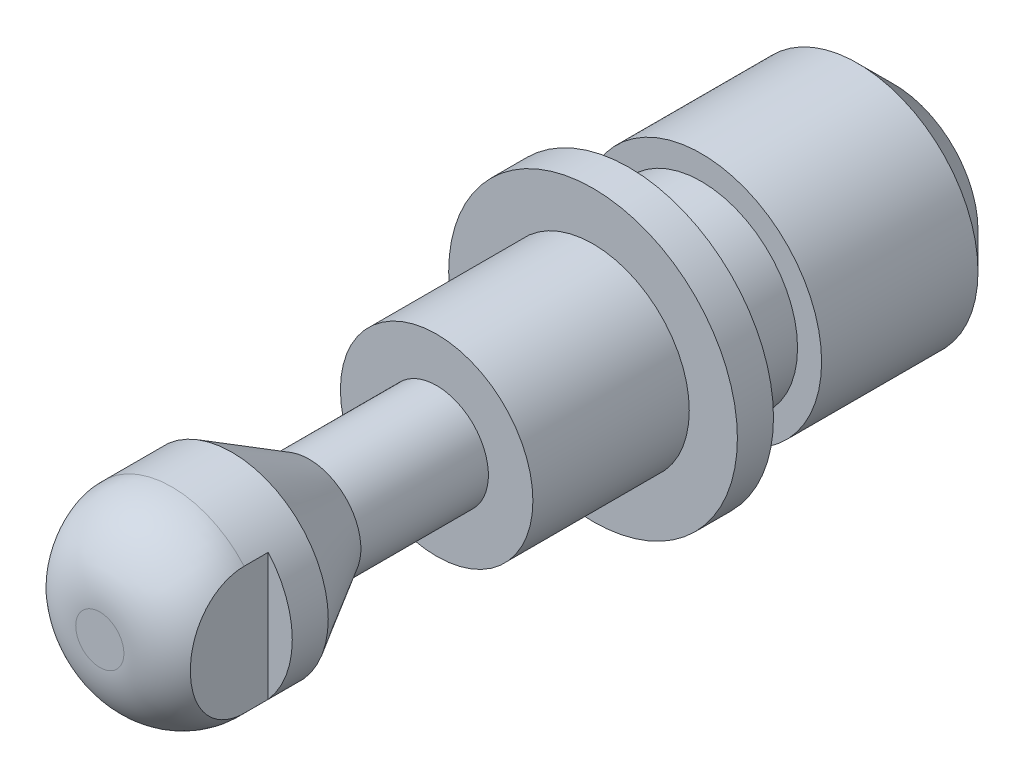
ISO-10303-21;
HEADER;
FILE_DESCRIPTION(('STEP AP214'),'2;1');
FILE_NAME('part.step','',(''),(''),'','','');
FILE_SCHEMA(('AUTOMOTIVE_DESIGN { 1 0 10303 214 1 1 1 1 }'));
ENDSEC;
DATA;
#1=APPLICATION_CONTEXT('core data for automotive mechanical design processes');
#2=APPLICATION_PROTOCOL_DEFINITION('international standard','automotive_design',2000,#1);
#3=PRODUCT_CONTEXT('',#1,'mechanical');
#4=PRODUCT('Part','Part','',(#3));
#5=PRODUCT_RELATED_PRODUCT_CATEGORY('part','',(#4));
#6=PRODUCT_DEFINITION_FORMATION('','',#4);
#7=PRODUCT_DEFINITION_CONTEXT('part definition',#1,'design');
#8=PRODUCT_DEFINITION('design','',#6,#7);
#9=PRODUCT_DEFINITION_SHAPE('','',#8);
#10=(LENGTH_UNIT() NAMED_UNIT(*) SI_UNIT(.MILLI.,.METRE.));
#11=(NAMED_UNIT(*) PLANE_ANGLE_UNIT() SI_UNIT($,.RADIAN.));
#12=(NAMED_UNIT(*) SI_UNIT($,.STERADIAN.) SOLID_ANGLE_UNIT());
#13=UNCERTAINTY_MEASURE_WITH_UNIT(LENGTH_MEASURE(1.E-05),#10,'distance_accuracy_value','');
#14=(GEOMETRIC_REPRESENTATION_CONTEXT(3) GLOBAL_UNCERTAINTY_ASSIGNED_CONTEXT((#13)) GLOBAL_UNIT_ASSIGNED_CONTEXT((#10,
#11,#12)) REPRESENTATION_CONTEXT('',''));
#15=CARTESIAN_POINT('',(0.,0.,0.));
#16=DIRECTION('',(0.,0.,1.));
#17=DIRECTION('',(1.,0.,0.));
#18=AXIS2_PLACEMENT_3D('',#15,#16,#17);
#19=CARTESIAN_POINT('',(0.,0.,0.));
#20=DIRECTION('',(0.,0.,-1.));
#21=DIRECTION('',(-1.,0.,0.));
#22=AXIS2_PLACEMENT_3D('',#19,#20,#21);
#23=CYLINDRICAL_SURFACE('',#22,6.);
#24=CARTESIAN_POINT('',(0.,0.,0.));
#25=DIRECTION('',(0.,0.,-1.));
#26=DIRECTION('',(-1.,0.,0.));
#27=AXIS2_PLACEMENT_3D('',#24,#25,#26);
#28=CIRCLE('',#27,6.);
#29=CARTESIAN_POINT('',(-6.,0.,0.));
#30=VERTEX_POINT('',#29);
#31=EDGE_CURVE('E82',#30,#30,#28,.T.);
#32=ORIENTED_EDGE('',*,*,#31,.F.);
#33=EDGE_LOOP('',(#32));
#34=FACE_BOUND('',#33,.T.);
#35=CARTESIAN_POINT('',(0.,0.,1.5));
#36=DIRECTION('',(0.,0.,-1.));
#37=DIRECTION('',(-1.,0.,0.));
#38=AXIS2_PLACEMENT_3D('',#35,#36,#37);
#39=CIRCLE('',#38,6.);
#40=CARTESIAN_POINT('',(-6.,0.,1.5));
#41=VERTEX_POINT('',#40);
#42=EDGE_CURVE('E109',#41,#41,#39,.T.);
#43=ORIENTED_EDGE('',*,*,#42,.T.);
#44=EDGE_LOOP('',(#43));
#45=FACE_BOUND('',#44,.T.);
#46=ADVANCED_FACE('F14',(#34,#45),#23,.T.);
#47=CARTESIAN_POINT('',(0.,6.,1.5));
#48=DIRECTION('',(0.,0.,-1.));
#49=DIRECTION('',(-1.,0.,0.));
#50=AXIS2_PLACEMENT_3D('',#47,#48,#49);
#51=PLANE('',#50);
#52=ORIENTED_EDGE('',*,*,#42,.F.);
#53=EDGE_LOOP('',(#52));
#54=FACE_BOUND('',#53,.T.);
#55=CARTESIAN_POINT('',(0.,0.,1.5));
#56=DIRECTION('',(0.,0.,-1.));
#57=DIRECTION('',(-1.,0.,0.));
#58=AXIS2_PLACEMENT_3D('',#55,#56,#57);
#59=CIRCLE('',#58,4.);
#60=CARTESIAN_POINT('',(-4.,0.,1.5));
#61=VERTEX_POINT('',#60);
#62=EDGE_CURVE('E106',#61,#61,#59,.T.);
#63=ORIENTED_EDGE('',*,*,#62,.T.);
#64=EDGE_LOOP('',(#63));
#65=FACE_BOUND('',#64,.T.);
#66=ADVANCED_FACE('F156',(#54,#65),#51,.F.);
#67=CARTESIAN_POINT('',(0.,0.,0.));
#68=DIRECTION('',(0.,0.,-1.));
#69=DIRECTION('',(-1.,0.,0.));
#70=AXIS2_PLACEMENT_3D('',#67,#68,#69);
#71=CYLINDRICAL_SURFACE('',#70,4.);
#72=ORIENTED_EDGE('',*,*,#62,.F.);
#73=EDGE_LOOP('',(#72));
#74=FACE_BOUND('',#73,.T.);
#75=CARTESIAN_POINT('',(0.,0.,8.));
#76=DIRECTION('',(0.,0.,-1.));
#77=DIRECTION('',(-1.,0.,0.));
#78=AXIS2_PLACEMENT_3D('',#75,#76,#77);
#79=CIRCLE('',#78,4.);
#80=CARTESIAN_POINT('',(-4.,0.,8.));
#81=VERTEX_POINT('',#80);
#82=EDGE_CURVE('E103',#81,#81,#79,.T.);
#83=ORIENTED_EDGE('',*,*,#82,.T.);
#84=EDGE_LOOP('',(#83));
#85=FACE_BOUND('',#84,.T.);
#86=ADVANCED_FACE('F162',(#74,#85),#71,.T.);
#87=CARTESIAN_POINT('',(0.,2.15,8.));
#88=DIRECTION('',(0.,0.,-1.));
#89=DIRECTION('',(-1.,0.,0.));
#90=AXIS2_PLACEMENT_3D('',#87,#88,#89);
#91=PLANE('',#90);
#92=ORIENTED_EDGE('',*,*,#82,.F.);
#93=EDGE_LOOP('',(#92));
#94=FACE_BOUND('',#93,.T.);
#95=CARTESIAN_POINT('',(0.,0.,8.));
#96=DIRECTION('',(0.,0.,-1.));
#97=DIRECTION('',(-1.,0.,0.));
#98=AXIS2_PLACEMENT_3D('',#95,#96,#97);
#99=CIRCLE('',#98,2.15);
#100=CARTESIAN_POINT('',(-2.15,0.,8.));
#101=VERTEX_POINT('',#100);
#102=EDGE_CURVE('E100',#101,#101,#99,.T.);
#103=ORIENTED_EDGE('',*,*,#102,.T.);
#104=EDGE_LOOP('',(#103));
#105=FACE_BOUND('',#104,.T.);
#106=ADVANCED_FACE('F170',(#94,#105),#91,.F.);
#107=CARTESIAN_POINT('',(0.,0.,0.));
#108=DIRECTION('',(0.,0.,-1.));
#109=DIRECTION('',(-1.,0.,0.));
#110=AXIS2_PLACEMENT_3D('',#107,#108,#109);
#111=CYLINDRICAL_SURFACE('',#110,2.15);
#112=ORIENTED_EDGE('',*,*,#102,.F.);
#113=EDGE_LOOP('',(#112));
#114=FACE_BOUND('',#113,.T.);
#115=CARTESIAN_POINT('',(0.,0.,13.3));
#116=DIRECTION('',(0.,0.,-1.));
#117=DIRECTION('',(-1.,0.,0.));
#118=AXIS2_PLACEMENT_3D('',#115,#116,#117);
#119=CIRCLE('',#118,2.15);
#120=CARTESIAN_POINT('',(-2.15,0.,13.3));
#121=VERTEX_POINT('',#120);
#122=EDGE_CURVE('E97',#121,#121,#119,.T.);
#123=ORIENTED_EDGE('',*,*,#122,.T.);
#124=EDGE_LOOP('',(#123));
#125=FACE_BOUND('',#124,.T.);
#126=ADVANCED_FACE('F174',(#114,#125),#111,.T.);
#127=CARTESIAN_POINT('',(0.,0.,16.5042939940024));
#128=DIRECTION('',(0.,0.,1.));
#129=DIRECTION('',(1.,0.,0.));
#130=AXIS2_PLACEMENT_3D('',#127,#128,#129);
#131=CONICAL_SURFACE('',#130,4.,0.523598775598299);
#132=ORIENTED_EDGE('',*,*,#122,.F.);
#133=EDGE_LOOP('',(#132));
#134=FACE_BOUND('',#133,.T.);
#135=CARTESIAN_POINT('',(0.,0.,16.5042939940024));
#136=DIRECTION('',(0.,0.,-1.));
#137=DIRECTION('',(-1.,0.,0.));
#138=AXIS2_PLACEMENT_3D('',#135,#136,#137);
#139=CIRCLE('',#138,4.);
#140=CARTESIAN_POINT('',(-4.,0.,16.5042939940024));
#141=VERTEX_POINT('',#140);
#142=EDGE_CURVE('E94',#141,#141,#139,.T.);
#143=ORIENTED_EDGE('',*,*,#142,.T.);
#144=EDGE_LOOP('',(#143));
#145=FACE_BOUND('',#144,.T.);
#146=ADVANCED_FACE('F178',(#134,#145),#131,.T.);
#147=CARTESIAN_POINT('',(0.,0.,0.));
#148=DIRECTION('',(0.,0.,-1.));
#149=DIRECTION('',(-1.,0.,0.));
#150=AXIS2_PLACEMENT_3D('',#147,#148,#149);
#151=CYLINDRICAL_SURFACE('',#150,4.);
#152=CARTESIAN_POINT('',(0.,0.,19.));
#153=DIRECTION('',(0.,0.,-1.));
#154=DIRECTION('',(-1.,0.,0.));
#155=AXIS2_PLACEMENT_3D('',#152,#153,#154);
#156=CIRCLE('',#155,4.);
#157=CARTESIAN_POINT('',(-3.,2.6457513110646,19.));
#158=VERTEX_POINT('',#157);
#159=CARTESIAN_POINT('',(3.,2.6457513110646,19.));
#160=VERTEX_POINT('',#159);
#161=EDGE_CURVE('E71',#158,#160,#156,.T.);
#162=ORIENTED_EDGE('',*,*,#161,.T.);
#163=DIRECTION('',(0.,0.,-1.));
#164=VECTOR('',#163,1.);
#165=CARTESIAN_POINT('',(3.,2.6457513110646,0.));
#166=LINE('',#165,#164);
#167=CARTESIAN_POINT('',(3.,2.6457513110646,18.));
#168=VERTEX_POINT('',#167);
#169=EDGE_CURVE('E29',#160,#168,#166,.T.);
#170=ORIENTED_EDGE('',*,*,#169,.T.);
#171=CARTESIAN_POINT('',(0.,0.,18.));
#172=DIRECTION('',(0.,0.,1.));
#173=DIRECTION('',(1.,0.,0.));
#174=AXIS2_PLACEMENT_3D('',#171,#172,#173);
#175=CIRCLE('',#174,4.);
#176=CARTESIAN_POINT('',(3.,-2.6457513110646,18.));
#177=VERTEX_POINT('',#176);
#178=EDGE_CURVE('E58',#177,#168,#175,.T.);
#179=ORIENTED_EDGE('',*,*,#178,.F.);
#180=DIRECTION('',(0.,0.,-1.));
#181=VECTOR('',#180,1.);
#182=CARTESIAN_POINT('',(3.,-2.6457513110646,0.));
#183=LINE('',#182,#181);
#184=CARTESIAN_POINT('',(3.,-2.6457513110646,19.));
#185=VERTEX_POINT('',#184);
#186=EDGE_CURVE('E64',#177,#185,#183,.F.);
#187=ORIENTED_EDGE('',*,*,#186,.T.);
#188=CARTESIAN_POINT('',(-3.,-2.6457513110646,19.));
#189=VERTEX_POINT('',#188);
#190=EDGE_CURVE('E37',#185,#189,#156,.T.);
#191=ORIENTED_EDGE('',*,*,#190,.T.);
#192=DIRECTION('',(0.,0.,-1.));
#193=VECTOR('',#192,1.);
#194=CARTESIAN_POINT('',(-3.,-2.6457513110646,0.));
#195=LINE('',#194,#193);
#196=CARTESIAN_POINT('',(-3.,-2.6457513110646,18.));
#197=VERTEX_POINT('',#196);
#198=EDGE_CURVE('E80',#189,#197,#195,.T.);
#199=ORIENTED_EDGE('',*,*,#198,.T.);
#200=CARTESIAN_POINT('',(0.,0.,18.));
#201=DIRECTION('',(0.,0.,1.));
#202=DIRECTION('',(1.,0.,0.));
#203=AXIS2_PLACEMENT_3D('',#200,#201,#202);
#204=CIRCLE('',#203,4.);
#205=CARTESIAN_POINT('',(-3.,2.6457513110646,18.));
#206=VERTEX_POINT('',#205);
#207=EDGE_CURVE('E123',#206,#197,#204,.T.);
#208=ORIENTED_EDGE('',*,*,#207,.F.);
#209=DIRECTION('',(0.,0.,-1.));
#210=VECTOR('',#209,1.);
#211=CARTESIAN_POINT('',(-3.,2.6457513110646,0.));
#212=LINE('',#211,#210);
#213=EDGE_CURVE('E75',#206,#158,#212,.F.);
#214=ORIENTED_EDGE('',*,*,#213,.T.);
#215=EDGE_LOOP('',(#162,#170,#179,#187,#191,#199,#208,#214));
#216=FACE_BOUND('',#215,.T.);
#217=ORIENTED_EDGE('',*,*,#142,.F.);
#218=EDGE_LOOP('',(#217));
#219=FACE_BOUND('',#218,.T.);
#220=ADVANCED_FACE('F67',(#216,#219),#151,.T.);
#221=CARTESIAN_POINT('',(0.,0.,22.));
#222=DIRECTION('',(0.,0.,-1.));
#223=DIRECTION('',(-1.,0.,0.));
#224=AXIS2_PLACEMENT_3D('',#221,#222,#223);
#225=PLANE('',#224);
#226=CARTESIAN_POINT('',(0.,0.,22.));
#227=DIRECTION('',(0.,0.,-1.));
#228=DIRECTION('',(-1.,0.,0.));
#229=AXIS2_PLACEMENT_3D('',#226,#227,#228);
#230=CIRCLE('',#229,1.);
#231=CARTESIAN_POINT('',(-1.,0.,22.));
#232=VERTEX_POINT('',#231);
#233=EDGE_CURVE('E113',#232,#232,#230,.F.);
#234=ORIENTED_EDGE('',*,*,#233,.T.);
#235=EDGE_LOOP('',(#234));
#236=FACE_BOUND('',#235,.T.);
#237=ADVANCED_FACE('F185',(#236),#225,.F.);
#238=CARTESIAN_POINT('',(0.,5.,-11.));
#239=DIRECTION('',(0.,0.,1.));
#240=DIRECTION('',(1.,0.,0.));
#241=AXIS2_PLACEMENT_3D('',#238,#239,#240);
#242=PLANE('',#241);
#243=CARTESIAN_POINT('',(0.,0.,-11.));
#244=DIRECTION('',(0.,0.,1.));
#245=DIRECTION('',(1.,0.,0.));
#246=AXIS2_PLACEMENT_3D('',#243,#244,#245);
#247=CIRCLE('',#246,3.5);
#248=CARTESIAN_POINT('',(3.5,0.,-11.));
#249=VERTEX_POINT('',#248);
#250=EDGE_CURVE('E22',#249,#249,#247,.F.);
#251=ORIENTED_EDGE('',*,*,#250,.T.);
#252=EDGE_LOOP('',(#251));
#253=FACE_BOUND('',#252,.T.);
#254=ADVANCED_FACE('F146',(#253),#242,.F.);
#255=CARTESIAN_POINT('',(0.,0.,0.));
#256=DIRECTION('',(0.,0.,-1.));
#257=DIRECTION('',(-1.,0.,0.));
#258=AXIS2_PLACEMENT_3D('',#255,#256,#257);
#259=CYLINDRICAL_SURFACE('',#258,5.);
#260=CARTESIAN_POINT('',(0.,0.,-9.5));
#261=DIRECTION('',(0.,0.,1.));
#262=DIRECTION('',(1.,0.,0.));
#263=AXIS2_PLACEMENT_3D('',#260,#261,#262);
#264=CIRCLE('',#263,5.);
#265=CARTESIAN_POINT('',(5.,0.,-9.5));
#266=VERTEX_POINT('',#265);
#267=EDGE_CURVE('E9',#266,#266,#264,.T.);
#268=ORIENTED_EDGE('',*,*,#267,.T.);
#269=EDGE_LOOP('',(#268));
#270=FACE_BOUND('',#269,.T.);
#271=CARTESIAN_POINT('',(0.,0.,-3.));
#272=DIRECTION('',(0.,0.,-1.));
#273=DIRECTION('',(-1.,0.,0.));
#274=AXIS2_PLACEMENT_3D('',#271,#272,#273);
#275=CIRCLE('',#274,5.);
#276=CARTESIAN_POINT('',(-5.,0.,-3.));
#277=VERTEX_POINT('',#276);
#278=EDGE_CURVE('E91',#277,#277,#275,.T.);
#279=ORIENTED_EDGE('',*,*,#278,.T.);
#280=EDGE_LOOP('',(#279));
#281=FACE_BOUND('',#280,.T.);
#282=ADVANCED_FACE('F191',(#270,#281),#259,.T.);
#283=CARTESIAN_POINT('',(0.,4.,-3.));
#284=DIRECTION('',(0.,0.,-1.));
#285=DIRECTION('',(-1.,0.,0.));
#286=AXIS2_PLACEMENT_3D('',#283,#284,#285);
#287=PLANE('',#286);
#288=ORIENTED_EDGE('',*,*,#278,.F.);
#289=EDGE_LOOP('',(#288));
#290=FACE_BOUND('',#289,.T.);
#291=CARTESIAN_POINT('',(0.,0.,-3.));
#292=DIRECTION('',(0.,0.,-1.));
#293=DIRECTION('',(-1.,0.,0.));
#294=AXIS2_PLACEMENT_3D('',#291,#292,#293);
#295=CIRCLE('',#294,4.);
#296=CARTESIAN_POINT('',(-4.,0.,-3.));
#297=VERTEX_POINT('',#296);
#298=EDGE_CURVE('E88',#297,#297,#295,.T.);
#299=ORIENTED_EDGE('',*,*,#298,.T.);
#300=EDGE_LOOP('',(#299));
#301=FACE_BOUND('',#300,.T.);
#302=ADVANCED_FACE('F194',(#290,#301),#287,.F.);
#303=CARTESIAN_POINT('',(0.,0.,0.));
#304=DIRECTION('',(0.,0.,-1.));
#305=DIRECTION('',(-1.,0.,0.));
#306=AXIS2_PLACEMENT_3D('',#303,#304,#305);
#307=CYLINDRICAL_SURFACE('',#306,4.);
#308=ORIENTED_EDGE('',*,*,#298,.F.);
#309=EDGE_LOOP('',(#308));
#310=FACE_BOUND('',#309,.T.);
#311=CARTESIAN_POINT('',(0.,0.,0.));
#312=DIRECTION('',(0.,0.,-1.));
#313=DIRECTION('',(-1.,0.,0.));
#314=AXIS2_PLACEMENT_3D('',#311,#312,#313);
#315=CIRCLE('',#314,4.);
#316=CARTESIAN_POINT('',(-4.,0.,0.));
#317=VERTEX_POINT('',#316);
#318=EDGE_CURVE('E85',#317,#317,#315,.T.);
#319=ORIENTED_EDGE('',*,*,#318,.T.);
#320=EDGE_LOOP('',(#319));
#321=FACE_BOUND('',#320,.T.);
#322=ADVANCED_FACE('F198',(#310,#321),#307,.T.);
#323=CARTESIAN_POINT('',(0.,4.,0.));
#324=DIRECTION('',(0.,0.,1.));
#325=DIRECTION('',(1.,0.,0.));
#326=AXIS2_PLACEMENT_3D('',#323,#324,#325);
#327=PLANE('',#326);
#328=ORIENTED_EDGE('',*,*,#318,.F.);
#329=EDGE_LOOP('',(#328));
#330=FACE_BOUND('',#329,.T.);
#331=ORIENTED_EDGE('',*,*,#31,.T.);
#332=EDGE_LOOP('',(#331));
#333=FACE_BOUND('',#332,.T.);
#334=ADVANCED_FACE('F201',(#330,#333),#327,.F.);
#335=CARTESIAN_POINT('',(0.,0.,19.));
#336=DIRECTION('',(0.,0.,-1.));
#337=DIRECTION('',(-1.,0.,0.));
#338=AXIS2_PLACEMENT_3D('',#335,#336,#337);
#339=DEGENERATE_TOROIDAL_SURFACE('',#338,1.,3.,.T.);
#340=CARTESIAN_POINT('',(3.,0.,21.2360679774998));
#341=CARTESIAN_POINT('',(3.,-0.18213042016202,21.2360730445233));
#342=CARTESIAN_POINT('',(3.,-0.36431584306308,21.2213187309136));
#343=CARTESIAN_POINT('',(3.,-0.723592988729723,21.1613493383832));
#344=CARTESIAN_POINT('',(3.,-0.900689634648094,21.1161648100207));
#345=CARTESIAN_POINT('',(3.,-1.20801765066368,21.0061514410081));
#346=CARTESIAN_POINT('',(3.,-1.3403812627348,20.9472966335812));
#347=CARTESIAN_POINT('',(3.,-1.59371415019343,20.8086382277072));
#348=CARTESIAN_POINT('',(3.,-1.71469026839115,20.7288473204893));
#349=CARTESIAN_POINT('',(3.,-1.94131475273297,20.548058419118));
#350=CARTESIAN_POINT('',(3.,-2.04683753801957,20.4469014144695));
#351=CARTESIAN_POINT('',(3.,-2.23610882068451,20.2258543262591));
#352=CARTESIAN_POINT('',(3.,-2.31987165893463,20.1059766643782));
#353=CARTESIAN_POINT('',(3.,-2.45137620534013,19.8685696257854));
#354=CARTESIAN_POINT('',(3.,-2.50243931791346,19.7528750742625));
#355=CARTESIAN_POINT('',(3.,-2.58222641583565,19.5140328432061));
#356=CARTESIAN_POINT('',(3.,-2.61096503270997,19.3908901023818));
#357=CARTESIAN_POINT('',(3.,-2.64317885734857,19.1526642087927));
#358=CARTESIAN_POINT('',(3.,-2.64869439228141,19.0378527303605));
#359=CARTESIAN_POINT('',(3.,-2.63985285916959,18.8090131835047));
#360=CARTESIAN_POINT('',(3.,-2.62550060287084,18.6949849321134));
#361=CARTESIAN_POINT('',(3.,-2.57811323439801,18.4737675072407));
#362=CARTESIAN_POINT('',(3.,-2.54553396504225,18.366479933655));
#363=CARTESIAN_POINT('',(3.,-2.46330877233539,18.1586814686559));
#364=CARTESIAN_POINT('',(3.,-2.41366206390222,18.0581708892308));
#365=CARTESIAN_POINT('',(3.,-2.29748673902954,17.8635303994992));
#366=CARTESIAN_POINT('',(3.,-2.23051545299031,17.769665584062));
#367=CARTESIAN_POINT('',(3.,-2.08284770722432,17.5934794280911));
#368=CARTESIAN_POINT('',(3.,-2.00214781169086,17.5111609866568));
#369=CARTESIAN_POINT('',(3.,-1.8226461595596,17.3531312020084));
#370=CARTESIAN_POINT('',(3.,-1.72291044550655,17.2784840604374));
#371=CARTESIAN_POINT('',(3.,-1.5136045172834,17.1446444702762));
#372=CARTESIAN_POINT('',(3.,-1.40403016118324,17.0854585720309));
#373=CARTESIAN_POINT('',(3.,-1.16220414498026,16.9752876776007));
#374=CARTESIAN_POINT('',(3.,-1.0289168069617,16.9265841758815));
#375=CARTESIAN_POINT('',(3.,-0.756854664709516,16.8483168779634));
#376=CARTESIAN_POINT('',(3.,-0.618076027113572,16.8187667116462));
#377=CARTESIAN_POINT('',(3.,-0.311732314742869,16.7741468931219));
#378=CARTESIAN_POINT('',(3.,-0.143620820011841,16.7628003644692));
#379=CARTESIAN_POINT('',(3.,0.192610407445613,16.7652425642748));
#380=CARTESIAN_POINT('',(3.,0.360729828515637,16.7790661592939));
#381=CARTESIAN_POINT('',(3.,0.711775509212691,16.8356870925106));
#382=CARTESIAN_POINT('',(3.,0.894221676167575,16.8815892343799));
#383=CARTESIAN_POINT('',(3.,1.24678385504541,17.0076571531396));
#384=CARTESIAN_POINT('',(3.,1.41692949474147,17.0877371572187));
#385=CARTESIAN_POINT('',(3.,1.68782709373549,17.253590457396));
#386=CARTESIAN_POINT('',(3.,1.79407437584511,17.3304326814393));
#387=CARTESIAN_POINT('',(3.,1.99244199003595,17.5006681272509));
#388=CARTESIAN_POINT('',(3.,2.08456939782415,17.5940530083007));
#389=CARTESIAN_POINT('',(3.,2.25136410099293,17.796238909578));
#390=CARTESIAN_POINT('',(3.,2.32593419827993,17.9051206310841));
#391=CARTESIAN_POINT('',(3.,2.45340856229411,18.1349484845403));
#392=CARTESIAN_POINT('',(3.,2.50632050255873,18.2558903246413));
#393=CARTESIAN_POINT('',(3.,2.58380733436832,18.4936035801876));
#394=CARTESIAN_POINT('',(3.,2.61062950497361,18.6096453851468));
#395=CARTESIAN_POINT('',(3.,2.64319909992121,18.8446356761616));
#396=CARTESIAN_POINT('',(3.,2.648955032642,18.9635829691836));
#397=CARTESIAN_POINT('',(3.,2.6394119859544,19.1942716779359));
#398=CARTESIAN_POINT('',(3.,2.6252141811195,19.3060605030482));
#399=CARTESIAN_POINT('',(3.,2.57829739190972,19.525661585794));
#400=CARTESIAN_POINT('',(3.,2.54557999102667,19.63347418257));
#401=CARTESIAN_POINT('',(3.,2.46277618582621,19.8425934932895));
#402=CARTESIAN_POINT('',(3.,2.41263246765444,19.9438774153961));
#403=CARTESIAN_POINT('',(3.,2.29688023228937,20.1371530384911));
#404=CARTESIAN_POINT('',(3.,2.23126933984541,20.229143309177));
#405=CARTESIAN_POINT('',(3.,2.08293087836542,20.4067191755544));
#406=CARTESIAN_POINT('',(3.,1.99947023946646,20.4916905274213));
#407=CARTESIAN_POINT('',(3.,1.82071046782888,20.6480453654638));
#408=CARTESIAN_POINT('',(3.,1.72540724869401,20.7194241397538));
#409=CARTESIAN_POINT('',(3.,1.51485660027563,20.8550675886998));
#410=CARTESIAN_POINT('',(3.,1.39856751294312,20.9177097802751));
#411=CARTESIAN_POINT('',(3.,1.15828317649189,21.0257432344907));
#412=CARTESIAN_POINT('',(3.,1.03428427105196,21.0711262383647));
#413=CARTESIAN_POINT('',(3.,0.760833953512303,21.1513162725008));
#414=CARTESIAN_POINT('',(3.,0.610526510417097,21.1831966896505));
#415=CARTESIAN_POINT('',(3.,0.306828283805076,21.2255846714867));
#416=CARTESIAN_POINT('',(3.,0.153433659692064,21.2360637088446));
#417=CARTESIAN_POINT('',(3.,0.,21.2360679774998));
#418=B_SPLINE_CURVE_WITH_KNOTS('',3,(#340,#341,#342,#343,#344,#345,#346,#347,#348,#349,#350,
#351,#352,#353,#354,#355,#356,#357,#358,#359,#360,#361,#362,#363,#364,#365,#366,#367,#368,#369,
#370,#371,#372,#373,#374,#375,#376,#377,#378,#379,#380,#381,#382,#383,#384,#385,#386,#387,#388,
#389,#390,#391,#392,#393,#394,#395,#396,#397,#398,#399,#400,#401,#402,#403,#404,#405,#406,#407,
#408,#409,#410,#411,#412,#413,#414,#415,#416,#417),.UNSPECIFIED.,.T.,.F.,(4,2,2,2,2,2,2,2,2,2,2,
2,2,2,2,2,2,2,2,2,2,2,2,2,2,2,2,2,2,2,2,2,2,2,2,2,2,2,4),(0.,0.545881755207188,1.09121628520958,
1.52407148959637,1.95666490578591,2.39259896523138,2.82824498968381,3.20555876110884,
3.58262503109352,3.92576653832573,4.26882495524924,4.60366436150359,4.93851917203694,
5.28296170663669,5.62749057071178,5.99973468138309,6.37213624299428,6.79627198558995,
7.2207092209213,7.72421554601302,8.22841987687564,8.78974139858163,9.34966243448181,
9.74144173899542,10.1330240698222,10.5267257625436,10.9202878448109,11.2757520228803,
11.6310726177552,11.9675363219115,12.3039712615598,12.6415233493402,12.9791273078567,
13.3349649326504,13.6909256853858,14.0856703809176,14.4806037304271,14.9398637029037,
15.3997354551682),.UNSPECIFIED.);
#419=EDGE_CURVE('E61',#160,#185,#418,.T.);
#420=ORIENTED_EDGE('',*,*,#419,.F.);
#421=ORIENTED_EDGE('',*,*,#161,.F.);
#422=CARTESIAN_POINT('',(-3.,0.,21.2360679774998));
#423=CARTESIAN_POINT('',(-3.,0.18213042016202,21.2360730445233));
#424=CARTESIAN_POINT('',(-3.,0.36431584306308,21.2213187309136));
#425=CARTESIAN_POINT('',(-3.,0.723592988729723,21.1613493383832));
#426=CARTESIAN_POINT('',(-3.,0.900689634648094,21.1161648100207));
#427=CARTESIAN_POINT('',(-3.,1.20801765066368,21.0061514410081));
#428=CARTESIAN_POINT('',(-3.,1.3403812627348,20.9472966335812));
#429=CARTESIAN_POINT('',(-3.,1.59371415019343,20.8086382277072));
#430=CARTESIAN_POINT('',(-3.,1.71469026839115,20.7288473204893));
#431=CARTESIAN_POINT('',(-3.,1.94131475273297,20.548058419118));
#432=CARTESIAN_POINT('',(-3.,2.04683753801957,20.4469014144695));
#433=CARTESIAN_POINT('',(-3.,2.23610882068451,20.2258543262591));
#434=CARTESIAN_POINT('',(-3.,2.31987165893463,20.1059766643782));
#435=CARTESIAN_POINT('',(-3.,2.45137620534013,19.8685696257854));
#436=CARTESIAN_POINT('',(-3.,2.50243931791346,19.7528750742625));
#437=CARTESIAN_POINT('',(-3.,2.58222641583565,19.5140328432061));
#438=CARTESIAN_POINT('',(-3.,2.61096503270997,19.3908901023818));
#439=CARTESIAN_POINT('',(-3.,2.64317885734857,19.1526642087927));
#440=CARTESIAN_POINT('',(-3.,2.64869439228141,19.0378527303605));
#441=CARTESIAN_POINT('',(-3.,2.6398528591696,18.8090131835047));
#442=CARTESIAN_POINT('',(-3.,2.62550060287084,18.6949849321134));
#443=CARTESIAN_POINT('',(-3.,2.57811323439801,18.4737675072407));
#444=CARTESIAN_POINT('',(-3.,2.54553396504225,18.366479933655));
#445=CARTESIAN_POINT('',(-3.,2.46330877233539,18.1586814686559));
#446=CARTESIAN_POINT('',(-3.,2.41366206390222,18.0581708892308));
#447=CARTESIAN_POINT('',(-3.,2.29748673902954,17.8635303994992));
#448=CARTESIAN_POINT('',(-3.,2.23051545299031,17.769665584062));
#449=CARTESIAN_POINT('',(-3.,2.08284770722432,17.5934794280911));
#450=CARTESIAN_POINT('',(-3.,2.00214781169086,17.5111609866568));
#451=CARTESIAN_POINT('',(-3.,1.8226461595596,17.3531312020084));
#452=CARTESIAN_POINT('',(-3.,1.72291044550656,17.2784840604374));
#453=CARTESIAN_POINT('',(-3.,1.5136045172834,17.1446444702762));
#454=CARTESIAN_POINT('',(-3.,1.40403016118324,17.0854585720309));
#455=CARTESIAN_POINT('',(-3.,1.16220414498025,16.9752876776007));
#456=CARTESIAN_POINT('',(-3.,1.0289168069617,16.9265841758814));
#457=CARTESIAN_POINT('',(-3.,0.756854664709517,16.8483168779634));
#458=CARTESIAN_POINT('',(-3.,0.618076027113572,16.8187667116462));
#459=CARTESIAN_POINT('',(-3.,0.311732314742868,16.7741468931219));
#460=CARTESIAN_POINT('',(-3.,0.143620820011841,16.7628003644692));
#461=CARTESIAN_POINT('',(-3.,-0.192610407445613,16.7652425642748));
#462=CARTESIAN_POINT('',(-3.,-0.360729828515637,16.7790661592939));
#463=CARTESIAN_POINT('',(-3.,-0.711775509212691,16.8356870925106));
#464=CARTESIAN_POINT('',(-3.,-0.894221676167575,16.8815892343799));
#465=CARTESIAN_POINT('',(-3.,-1.24678385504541,17.0076571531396));
#466=CARTESIAN_POINT('',(-3.,-1.41692949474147,17.0877371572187));
#467=CARTESIAN_POINT('',(-3.,-1.68782709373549,17.253590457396));
#468=CARTESIAN_POINT('',(-3.,-1.79407437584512,17.3304326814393));
#469=CARTESIAN_POINT('',(-3.,-1.99244199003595,17.5006681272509));
#470=CARTESIAN_POINT('',(-3.,-2.08456939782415,17.5940530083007));
#471=CARTESIAN_POINT('',(-3.,-2.25136410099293,17.796238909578));
#472=CARTESIAN_POINT('',(-3.,-2.32593419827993,17.9051206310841));
#473=CARTESIAN_POINT('',(-3.,-2.45340856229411,18.1349484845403));
#474=CARTESIAN_POINT('',(-3.,-2.50632050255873,18.2558903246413));
#475=CARTESIAN_POINT('',(-3.,-2.58380733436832,18.4936035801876));
#476=CARTESIAN_POINT('',(-3.,-2.61062950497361,18.6096453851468));
#477=CARTESIAN_POINT('',(-3.,-2.64319909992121,18.8446356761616));
#478=CARTESIAN_POINT('',(-3.,-2.648955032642,18.9635829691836));
#479=CARTESIAN_POINT('',(-3.,-2.6394119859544,19.1942716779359));
#480=CARTESIAN_POINT('',(-3.,-2.6252141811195,19.3060605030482));
#481=CARTESIAN_POINT('',(-3.,-2.57829739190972,19.525661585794));
#482=CARTESIAN_POINT('',(-3.,-2.54557999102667,19.63347418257));
#483=CARTESIAN_POINT('',(-3.,-2.46277618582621,19.8425934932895));
#484=CARTESIAN_POINT('',(-3.,-2.41263246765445,19.9438774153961));
#485=CARTESIAN_POINT('',(-3.,-2.29688023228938,20.1371530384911));
#486=CARTESIAN_POINT('',(-3.,-2.23126933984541,20.229143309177));
#487=CARTESIAN_POINT('',(-3.,-2.08293087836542,20.4067191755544));
#488=CARTESIAN_POINT('',(-3.,-1.99947023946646,20.4916905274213));
#489=CARTESIAN_POINT('',(-3.,-1.82071046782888,20.6480453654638));
#490=CARTESIAN_POINT('',(-3.,-1.72540724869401,20.7194241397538));
#491=CARTESIAN_POINT('',(-3.,-1.51485660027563,20.8550675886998));
#492=CARTESIAN_POINT('',(-3.,-1.39856751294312,20.9177097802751));
#493=CARTESIAN_POINT('',(-3.,-1.15828317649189,21.0257432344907));
#494=CARTESIAN_POINT('',(-3.,-1.03428427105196,21.0711262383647));
#495=CARTESIAN_POINT('',(-3.,-0.760833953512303,21.1513162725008));
#496=CARTESIAN_POINT('',(-3.,-0.610526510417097,21.1831966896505));
#497=CARTESIAN_POINT('',(-3.,-0.306828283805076,21.2255846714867));
#498=CARTESIAN_POINT('',(-3.,-0.153433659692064,21.2360637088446));
#499=CARTESIAN_POINT('',(-3.,0.,21.2360679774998));
#500=B_SPLINE_CURVE_WITH_KNOTS('',3,(#422,#423,#424,#425,#426,#427,#428,#429,#430,#431,#432,
#433,#434,#435,#436,#437,#438,#439,#440,#441,#442,#443,#444,#445,#446,#447,#448,#449,#450,#451,
#452,#453,#454,#455,#456,#457,#458,#459,#460,#461,#462,#463,#464,#465,#466,#467,#468,#469,#470,
#471,#472,#473,#474,#475,#476,#477,#478,#479,#480,#481,#482,#483,#484,#485,#486,#487,#488,#489,
#490,#491,#492,#493,#494,#495,#496,#497,#498,#499),.UNSPECIFIED.,.T.,.F.,(4,2,2,2,2,2,2,2,2,2,2,
2,2,2,2,2,2,2,2,2,2,2,2,2,2,2,2,2,2,2,2,2,2,2,2,2,2,2,4),(0.,0.545881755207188,1.09121628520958,
1.52407148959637,1.95666490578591,2.39259896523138,2.82824498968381,3.20555876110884,
3.58262503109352,3.92576653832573,4.26882495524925,4.60366436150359,4.93851917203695,
5.28296170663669,5.62749057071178,5.99973468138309,6.37213624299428,6.79627198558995,
7.2207092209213,7.72421554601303,8.22841987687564,8.78974139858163,9.34966243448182,
9.74144173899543,10.1330240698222,10.5267257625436,10.9202878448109,11.2757520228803,
11.6310726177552,11.9675363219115,12.3039712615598,12.6415233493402,12.9791273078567,
13.3349649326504,13.6909256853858,14.0856703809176,14.4806037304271,14.9398637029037,
15.3997354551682),.UNSPECIFIED.);
#501=EDGE_CURVE('E116',#189,#158,#500,.T.);
#502=ORIENTED_EDGE('',*,*,#501,.F.);
#503=ORIENTED_EDGE('',*,*,#190,.F.);
#504=EDGE_LOOP('',(#420,#421,#502,#503));
#505=FACE_BOUND('',#504,.T.);
#506=ORIENTED_EDGE('',*,*,#233,.F.);
#507=EDGE_LOOP('',(#506));
#508=FACE_BOUND('',#507,.T.);
#509=ADVANCED_FACE('F125',(#505,#508),#339,.T.);
#510=CARTESIAN_POINT('',(-3.,-6.25,18.));
#511=DIRECTION('',(0.,0.,1.));
#512=DIRECTION('',(1.,0.,0.));
#513=AXIS2_PLACEMENT_3D('',#510,#511,#512);
#514=PLANE('',#513);
#515=ORIENTED_EDGE('',*,*,#207,.T.);
#516=DIRECTION('',(0.,1.,0.));
#517=VECTOR('',#516,1.);
#518=CARTESIAN_POINT('',(-3.,-6.25,18.));
#519=LINE('',#518,#517);
#520=EDGE_CURVE('E72',#197,#206,#519,.T.);
#521=ORIENTED_EDGE('',*,*,#520,.T.);
#522=EDGE_LOOP('',(#515,#521));
#523=FACE_BOUND('',#522,.T.);
#524=ADVANCED_FACE('F132',(#523),#514,.T.);
#525=CARTESIAN_POINT('',(-3.,-6.25,18.));
#526=DIRECTION('',(1.,0.,0.));
#527=DIRECTION('',(0.,-1.,0.));
#528=AXIS2_PLACEMENT_3D('',#525,#526,#527);
#529=PLANE('',#528);
#530=ORIENTED_EDGE('',*,*,#501,.T.);
#531=ORIENTED_EDGE('',*,*,#213,.F.);
#532=ORIENTED_EDGE('',*,*,#520,.F.);
#533=ORIENTED_EDGE('',*,*,#198,.F.);
#534=EDGE_LOOP('',(#530,#531,#532,#533));
#535=FACE_BOUND('',#534,.T.);
#536=ADVANCED_FACE('F128',(#535),#529,.F.);
#537=CARTESIAN_POINT('',(5.5,7.5,18.));
#538=DIRECTION('',(0.,0.,1.));
#539=DIRECTION('',(1.,0.,0.));
#540=AXIS2_PLACEMENT_3D('',#537,#538,#539);
#541=PLANE('',#540);
#542=ORIENTED_EDGE('',*,*,#178,.T.);
#543=DIRECTION('',(0.,-1.,0.));
#544=VECTOR('',#543,1.);
#545=CARTESIAN_POINT('',(3.,-6.25,18.));
#546=LINE('',#545,#544);
#547=EDGE_CURVE('E60',#168,#177,#546,.T.);
#548=ORIENTED_EDGE('',*,*,#547,.T.);
#549=EDGE_LOOP('',(#542,#548));
#550=FACE_BOUND('',#549,.T.);
#551=ADVANCED_FACE('F59',(#550),#541,.T.);
#552=CARTESIAN_POINT('',(3.,-6.25,18.));
#553=DIRECTION('',(-1.,0.,0.));
#554=DIRECTION('',(0.,1.,0.));
#555=AXIS2_PLACEMENT_3D('',#552,#553,#554);
#556=PLANE('',#555);
#557=ORIENTED_EDGE('',*,*,#419,.T.);
#558=ORIENTED_EDGE('',*,*,#186,.F.);
#559=ORIENTED_EDGE('',*,*,#547,.F.);
#560=ORIENTED_EDGE('',*,*,#169,.F.);
#561=EDGE_LOOP('',(#557,#558,#559,#560));
#562=FACE_BOUND('',#561,.T.);
#563=ADVANCED_FACE('F63',(#562),#556,.F.);
#564=CARTESIAN_POINT('',(0.,0.,-11.));
#565=DIRECTION('',(0.,0.,1.));
#566=DIRECTION('',(1.,0.,0.));
#567=AXIS2_PLACEMENT_3D('',#564,#565,#566);
#568=CONICAL_SURFACE('',#567,3.5,0.785398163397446);
#569=ORIENTED_EDGE('',*,*,#267,.F.);
#570=EDGE_LOOP('',(#569));
#571=FACE_BOUND('',#570,.T.);
#572=ORIENTED_EDGE('',*,*,#250,.F.);
#573=EDGE_LOOP('',(#572));
#574=FACE_BOUND('',#573,.T.);
#575=ADVANCED_FACE('F16',(#571,#574),#568,.T.);
#576=CLOSED_SHELL('',(#46,#66,#86,#106,#126,#146,#220,#237,#254,#282,#302,#322,#334,#509,#524,
#536,#551,#563,#575));
#577=MANIFOLD_SOLID_BREP('B1',#576);
#578=ADVANCED_BREP_SHAPE_REPRESENTATION('',(#18,#577),#14);
#579=SHAPE_DEFINITION_REPRESENTATION(#9,#578);
ENDSEC;
END-ISO-10303-21;
